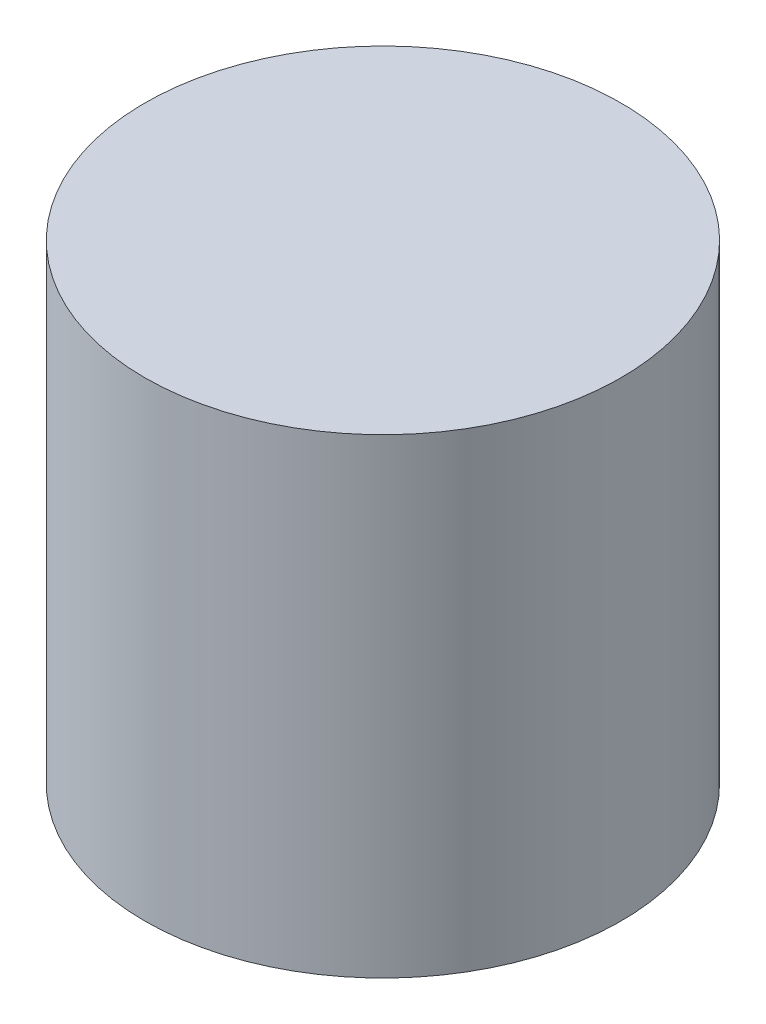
ISO-10303-21;
HEADER;
FILE_DESCRIPTION(('STEP AP214'),'2;1');
FILE_NAME('part.step','',(''),(''),'','','');
FILE_SCHEMA(('AUTOMOTIVE_DESIGN { 1 0 10303 214 1 1 1 1 }'));
ENDSEC;
DATA;
#1=APPLICATION_CONTEXT('core data for automotive mechanical design processes');
#2=APPLICATION_PROTOCOL_DEFINITION('international standard','automotive_design',2000,#1);
#3=PRODUCT_CONTEXT('',#1,'mechanical');
#4=PRODUCT('Part','Part','',(#3));
#5=PRODUCT_RELATED_PRODUCT_CATEGORY('part','',(#4));
#6=PRODUCT_DEFINITION_FORMATION('','',#4);
#7=PRODUCT_DEFINITION_CONTEXT('part definition',#1,'design');
#8=PRODUCT_DEFINITION('design','',#6,#7);
#9=PRODUCT_DEFINITION_SHAPE('','',#8);
#10=(LENGTH_UNIT() NAMED_UNIT(*) SI_UNIT(.MILLI.,.METRE.));
#11=(NAMED_UNIT(*) PLANE_ANGLE_UNIT() SI_UNIT($,.RADIAN.));
#12=(NAMED_UNIT(*) SI_UNIT($,.STERADIAN.) SOLID_ANGLE_UNIT());
#13=UNCERTAINTY_MEASURE_WITH_UNIT(LENGTH_MEASURE(1.E-05),#10,'distance_accuracy_value','');
#14=(GEOMETRIC_REPRESENTATION_CONTEXT(3) GLOBAL_UNCERTAINTY_ASSIGNED_CONTEXT((#13)) GLOBAL_UNIT_ASSIGNED_CONTEXT((#10,
#11,#12)) REPRESENTATION_CONTEXT('',''));
#15=CARTESIAN_POINT('',(0.,0.,0.));
#16=DIRECTION('',(0.,0.,1.));
#17=DIRECTION('',(1.,0.,0.));
#18=AXIS2_PLACEMENT_3D('',#15,#16,#17);
#19=CARTESIAN_POINT('',(0.,21.59,0.));
#20=DIRECTION('',(0.,-1.,0.));
#21=DIRECTION('',(0.,0.,-1.));
#22=AXIS2_PLACEMENT_3D('',#19,#20,#21);
#23=CYLINDRICAL_SURFACE('',#22,10.922);
#24=CARTESIAN_POINT('',(0.,21.59,0.));
#25=DIRECTION('',(0.,1.,0.));
#26=DIRECTION('',(0.,0.,1.));
#27=AXIS2_PLACEMENT_3D('',#24,#25,#26);
#28=CIRCLE('',#27,10.922);
#29=CARTESIAN_POINT('',(0.,21.59,10.922));
#30=VERTEX_POINT('',#29);
#31=EDGE_CURVE('E10',#30,#30,#28,.T.);
#32=ORIENTED_EDGE('',*,*,#31,.F.);
#33=EDGE_LOOP('',(#32));
#34=FACE_BOUND('',#33,.T.);
#35=CARTESIAN_POINT('',(0.,0.,0.));
#36=DIRECTION('',(0.,1.,0.));
#37=DIRECTION('',(0.,0.,1.));
#38=AXIS2_PLACEMENT_3D('',#35,#36,#37);
#39=CIRCLE('',#38,10.922);
#40=CARTESIAN_POINT('',(0.,0.,10.922));
#41=VERTEX_POINT('',#40);
#42=EDGE_CURVE('E33',#41,#41,#39,.T.);
#43=ORIENTED_EDGE('',*,*,#42,.T.);
#44=EDGE_LOOP('',(#43));
#45=FACE_BOUND('',#44,.T.);
#46=ADVANCED_FACE('F30',(#34,#45),#23,.T.);
#47=CARTESIAN_POINT('',(0.,21.59,0.));
#48=DIRECTION('',(0.,1.,0.));
#49=DIRECTION('',(0.,0.,1.));
#50=AXIS2_PLACEMENT_3D('',#47,#48,#49);
#51=PLANE('',#50);
#52=ORIENTED_EDGE('',*,*,#31,.T.);
#53=EDGE_LOOP('',(#52));
#54=FACE_BOUND('',#53,.T.);
#55=ADVANCED_FACE('F45',(#54),#51,.T.);
#56=CARTESIAN_POINT('',(0.,0.,0.));
#57=DIRECTION('',(0.,1.,0.));
#58=DIRECTION('',(0.,0.,1.));
#59=AXIS2_PLACEMENT_3D('',#56,#57,#58);
#60=PLANE('',#59);
#61=ORIENTED_EDGE('',*,*,#42,.F.);
#62=EDGE_LOOP('',(#61));
#63=FACE_BOUND('',#62,.T.);
#64=ADVANCED_FACE('F43',(#63),#60,.F.);
#65=CLOSED_SHELL('',(#46,#55,#64));
#66=MANIFOLD_SOLID_BREP('B2',#65);
#67=ADVANCED_BREP_SHAPE_REPRESENTATION('',(#18,#66),#14);
#68=SHAPE_DEFINITION_REPRESENTATION(#9,#67);
ENDSEC;
END-ISO-10303-21;
